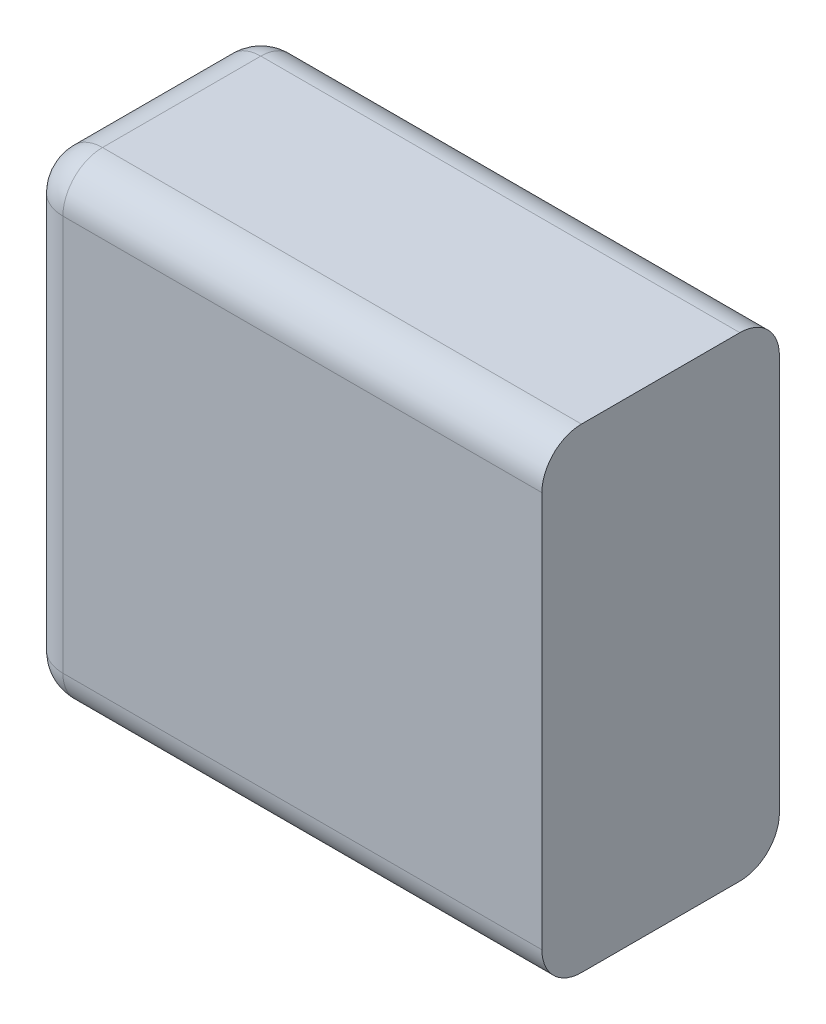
ISO-10303-21;
HEADER;
FILE_DESCRIPTION(('STEP AP214'),'2;1');
FILE_NAME('part.step','',(''),(''),'','','');
FILE_SCHEMA(('AUTOMOTIVE_DESIGN { 1 0 10303 214 1 1 1 1 }'));
ENDSEC;
DATA;
#1=APPLICATION_CONTEXT('core data for automotive mechanical design processes');
#2=APPLICATION_PROTOCOL_DEFINITION('international standard','automotive_design',2000,#1);
#3=PRODUCT_CONTEXT('',#1,'mechanical');
#4=PRODUCT('Part','Part','',(#3));
#5=PRODUCT_RELATED_PRODUCT_CATEGORY('part','',(#4));
#6=PRODUCT_DEFINITION_FORMATION('','',#4);
#7=PRODUCT_DEFINITION_CONTEXT('part definition',#1,'design');
#8=PRODUCT_DEFINITION('design','',#6,#7);
#9=PRODUCT_DEFINITION_SHAPE('','',#8);
#10=(LENGTH_UNIT() NAMED_UNIT(*) SI_UNIT(.MILLI.,.METRE.));
#11=(NAMED_UNIT(*) PLANE_ANGLE_UNIT() SI_UNIT($,.RADIAN.));
#12=(NAMED_UNIT(*) SI_UNIT($,.STERADIAN.) SOLID_ANGLE_UNIT());
#13=UNCERTAINTY_MEASURE_WITH_UNIT(LENGTH_MEASURE(1.E-05),#10,'distance_accuracy_value','');
#14=(GEOMETRIC_REPRESENTATION_CONTEXT(3) GLOBAL_UNCERTAINTY_ASSIGNED_CONTEXT((#13)) GLOBAL_UNIT_ASSIGNED_CONTEXT((#10,
#11,#12)) REPRESENTATION_CONTEXT('',''));
#15=CARTESIAN_POINT('',(0.,0.,0.));
#16=DIRECTION('',(0.,0.,1.));
#17=DIRECTION('',(1.,0.,0.));
#18=AXIS2_PLACEMENT_3D('',#15,#16,#17);
#19=CARTESIAN_POINT('',(680.,330.,400.));
#20=DIRECTION('',(0.,0.,1.));
#21=DIRECTION('',(1.,0.,0.));
#22=AXIS2_PLACEMENT_3D('',#19,#20,#21);
#23=PLANE('',#22);
#24=DIRECTION('',(0.,-1.,0.));
#25=VECTOR('',#24,1.);
#26=CARTESIAN_POINT('',(75.,330.,400.));
#27=LINE('',#26,#25);
#28=CARTESIAN_POINT('',(75.,250.,400.));
#29=VERTEX_POINT('',#28);
#30=CARTESIAN_POINT('',(75.,-250.,400.));
#31=VERTEX_POINT('',#30);
#32=EDGE_CURVE('E144',#29,#31,#27,.T.);
#33=ORIENTED_EDGE('',*,*,#32,.T.);
#34=DIRECTION('',(-1.,0.,0.));
#35=VECTOR('',#34,1.);
#36=CARTESIAN_POINT('',(680.,-250.,400.));
#37=LINE('',#36,#35);
#38=CARTESIAN_POINT('',(680.,-250.,400.));
#39=VERTEX_POINT('',#38);
#40=EDGE_CURVE('E143',#39,#31,#37,.T.);
#41=ORIENTED_EDGE('',*,*,#40,.F.);
#42=DIRECTION('',(0.,1.,0.));
#43=VECTOR('',#42,1.);
#44=CARTESIAN_POINT('',(680.,330.,400.));
#45=LINE('',#44,#43);
#46=CARTESIAN_POINT('',(680.,250.,400.));
#47=VERTEX_POINT('',#46);
#48=EDGE_CURVE('E11',#39,#47,#45,.T.);
#49=ORIENTED_EDGE('',*,*,#48,.T.);
#50=DIRECTION('',(-1.,0.,0.));
#51=VECTOR('',#50,1.);
#52=CARTESIAN_POINT('',(680.,250.,400.));
#53=LINE('',#52,#51);
#54=EDGE_CURVE('E57',#47,#29,#53,.T.);
#55=ORIENTED_EDGE('',*,*,#54,.T.);
#56=EDGE_LOOP('',(#33,#41,#49,#55));
#57=FACE_BOUND('',#56,.T.);
#58=ADVANCED_FACE('F46',(#57),#23,.T.);
#59=CARTESIAN_POINT('',(680.,-330.,100.));
#60=DIRECTION('',(0.,0.,-1.));
#61=DIRECTION('',(0.,-1.,0.));
#62=AXIS2_PLACEMENT_3D('',#59,#60,#61);
#63=PLANE('',#62);
#64=DIRECTION('',(0.,-1.,0.));
#65=VECTOR('',#64,1.);
#66=CARTESIAN_POINT('',(680.,-330.,100.));
#67=LINE('',#66,#65);
#68=CARTESIAN_POINT('',(680.,250.,100.));
#69=VERTEX_POINT('',#68);
#70=CARTESIAN_POINT('',(680.,-250.,100.));
#71=VERTEX_POINT('',#70);
#72=EDGE_CURVE('E123',#69,#71,#67,.T.);
#73=ORIENTED_EDGE('',*,*,#72,.T.);
#74=DIRECTION('',(1.,0.,0.));
#75=VECTOR('',#74,1.);
#76=CARTESIAN_POINT('',(680.,-250.,100.));
#77=LINE('',#76,#75);
#78=CARTESIAN_POINT('',(75.,-250.,100.));
#79=VERTEX_POINT('',#78);
#80=EDGE_CURVE('E196',#79,#71,#77,.T.);
#81=ORIENTED_EDGE('',*,*,#80,.F.);
#82=DIRECTION('',(0.,1.,0.));
#83=VECTOR('',#82,1.);
#84=CARTESIAN_POINT('',(75.,-330.,100.));
#85=LINE('',#84,#83);
#86=CARTESIAN_POINT('',(75.,250.,100.));
#87=VERTEX_POINT('',#86);
#88=EDGE_CURVE('E148',#79,#87,#85,.T.);
#89=ORIENTED_EDGE('',*,*,#88,.T.);
#90=DIRECTION('',(1.,0.,0.));
#91=VECTOR('',#90,1.);
#92=CARTESIAN_POINT('',(680.,250.,100.));
#93=LINE('',#92,#91);
#94=EDGE_CURVE('E149',#87,#69,#93,.T.);
#95=ORIENTED_EDGE('',*,*,#94,.T.);
#96=EDGE_LOOP('',(#73,#81,#89,#95));
#97=FACE_BOUND('',#96,.T.);
#98=ADVANCED_FACE('F311',(#97),#63,.T.);
#99=CARTESIAN_POINT('',(680.,300.,100.));
#100=DIRECTION('',(0.,1.,0.));
#101=DIRECTION('',(1.,0.,0.));
#102=AXIS2_PLACEMENT_3D('',#99,#100,#101);
#103=PLANE('',#102);
#104=DIRECTION('',(1.,0.,0.));
#105=VECTOR('',#104,1.);
#106=CARTESIAN_POINT('',(680.,300.,350.));
#107=LINE('',#106,#105);
#108=CARTESIAN_POINT('',(75.,300.,350.));
#109=VERTEX_POINT('',#108);
#110=CARTESIAN_POINT('',(680.,300.,350.));
#111=VERTEX_POINT('',#110);
#112=EDGE_CURVE('E114',#109,#111,#107,.T.);
#113=ORIENTED_EDGE('',*,*,#112,.T.);
#114=DIRECTION('',(0.,0.,-1.));
#115=VECTOR('',#114,1.);
#116=CARTESIAN_POINT('',(680.,300.,100.));
#117=LINE('',#116,#115);
#118=CARTESIAN_POINT('',(680.,300.,150.));
#119=VERTEX_POINT('',#118);
#120=EDGE_CURVE('E108',#111,#119,#117,.T.);
#121=ORIENTED_EDGE('',*,*,#120,.T.);
#122=DIRECTION('',(-1.,0.,0.));
#123=VECTOR('',#122,1.);
#124=CARTESIAN_POINT('',(680.,300.,150.));
#125=LINE('',#124,#123);
#126=CARTESIAN_POINT('',(75.,300.,150.));
#127=VERTEX_POINT('',#126);
#128=EDGE_CURVE('E101',#119,#127,#125,.T.);
#129=ORIENTED_EDGE('',*,*,#128,.T.);
#130=DIRECTION('',(0.,0.,1.));
#131=VECTOR('',#130,1.);
#132=CARTESIAN_POINT('',(75.,300.,100.));
#133=LINE('',#132,#131);
#134=EDGE_CURVE('E109',#127,#109,#133,.T.);
#135=ORIENTED_EDGE('',*,*,#134,.T.);
#136=EDGE_LOOP('',(#113,#121,#129,#135));
#137=FACE_BOUND('',#136,.T.);
#138=ADVANCED_FACE('F112',(#137),#103,.T.);
#139=CARTESIAN_POINT('',(680.,0.,100.));
#140=DIRECTION('',(-1.,0.,0.));
#141=DIRECTION('',(0.,0.,1.));
#142=AXIS2_PLACEMENT_3D('',#139,#140,#141);
#143=PLANE('',#142);
#144=ORIENTED_EDGE('',*,*,#48,.F.);
#145=CARTESIAN_POINT('',(680.,-250.,350.));
#146=DIRECTION('',(-1.,0.,0.));
#147=DIRECTION('',(0.,0.,-1.));
#148=AXIS2_PLACEMENT_3D('',#145,#146,#147);
#149=CIRCLE('',#148,50.);
#150=CARTESIAN_POINT('',(680.,-300.,350.));
#151=VERTEX_POINT('',#150);
#152=EDGE_CURVE('E224',#151,#39,#149,.T.);
#153=ORIENTED_EDGE('',*,*,#152,.F.);
#154=DIRECTION('',(0.,0.,-1.));
#155=VECTOR('',#154,1.);
#156=CARTESIAN_POINT('',(680.,-300.,100.));
#157=LINE('',#156,#155);
#158=CARTESIAN_POINT('',(680.,-300.,150.));
#159=VERTEX_POINT('',#158);
#160=EDGE_CURVE('E197',#151,#159,#157,.T.);
#161=ORIENTED_EDGE('',*,*,#160,.T.);
#162=CARTESIAN_POINT('',(680.,-250.,150.));
#163=DIRECTION('',(-1.,0.,0.));
#164=DIRECTION('',(0.,0.,-1.));
#165=AXIS2_PLACEMENT_3D('',#162,#163,#164);
#166=CIRCLE('',#165,50.);
#167=EDGE_CURVE('E213',#71,#159,#166,.T.);
#168=ORIENTED_EDGE('',*,*,#167,.F.);
#169=ORIENTED_EDGE('',*,*,#72,.F.);
#170=CARTESIAN_POINT('',(680.,250.,150.));
#171=DIRECTION('',(1.,0.,0.));
#172=DIRECTION('',(0.,0.,-1.));
#173=AXIS2_PLACEMENT_3D('',#170,#171,#172);
#174=CIRCLE('',#173,50.);
#175=EDGE_CURVE('E104',#69,#119,#174,.T.);
#176=ORIENTED_EDGE('',*,*,#175,.T.);
#177=ORIENTED_EDGE('',*,*,#120,.F.);
#178=CARTESIAN_POINT('',(680.,250.,350.));
#179=DIRECTION('',(1.,0.,0.));
#180=DIRECTION('',(0.,0.,-1.));
#181=AXIS2_PLACEMENT_3D('',#178,#179,#180);
#182=CIRCLE('',#181,50.);
#183=EDGE_CURVE('E126',#111,#47,#182,.T.);
#184=ORIENTED_EDGE('',*,*,#183,.T.);
#185=EDGE_LOOP('',(#144,#153,#161,#168,#169,#176,#177,#184));
#186=FACE_BOUND('',#185,.T.);
#187=ADVANCED_FACE('F120',(#186),#143,.F.);
#188=CARTESIAN_POINT('',(25.,0.,100.));
#189=DIRECTION('',(-1.,0.,0.));
#190=DIRECTION('',(0.,0.,1.));
#191=AXIS2_PLACEMENT_3D('',#188,#189,#190);
#192=PLANE('',#191);
#193=DIRECTION('',(0.,-1.,0.));
#194=VECTOR('',#193,1.);
#195=CARTESIAN_POINT('',(25.,0.,150.));
#196=LINE('',#195,#194);
#197=CARTESIAN_POINT('',(25.,250.,150.));
#198=VERTEX_POINT('',#197);
#199=CARTESIAN_POINT('',(25.,-250.,150.));
#200=VERTEX_POINT('',#199);
#201=EDGE_CURVE('E160',#198,#200,#196,.T.);
#202=ORIENTED_EDGE('',*,*,#201,.T.);
#203=DIRECTION('',(0.,0.,-1.));
#204=VECTOR('',#203,1.);
#205=CARTESIAN_POINT('',(25.,-250.,100.));
#206=LINE('',#205,#204);
#207=CARTESIAN_POINT('',(25.,-250.,350.));
#208=VERTEX_POINT('',#207);
#209=EDGE_CURVE('E191',#208,#200,#206,.T.);
#210=ORIENTED_EDGE('',*,*,#209,.F.);
#211=DIRECTION('',(0.,1.,0.));
#212=VECTOR('',#211,1.);
#213=CARTESIAN_POINT('',(25.,0.,350.));
#214=LINE('',#213,#212);
#215=CARTESIAN_POINT('',(25.,250.,350.));
#216=VERTEX_POINT('',#215);
#217=EDGE_CURVE('E133',#208,#216,#214,.T.);
#218=ORIENTED_EDGE('',*,*,#217,.T.);
#219=DIRECTION('',(0.,0.,-1.));
#220=VECTOR('',#219,1.);
#221=CARTESIAN_POINT('',(25.,250.,100.));
#222=LINE('',#221,#220);
#223=EDGE_CURVE('E164',#216,#198,#222,.T.);
#224=ORIENTED_EDGE('',*,*,#223,.T.);
#225=EDGE_LOOP('',(#202,#210,#218,#224));
#226=FACE_BOUND('',#225,.T.);
#227=ADVANCED_FACE('F295',(#226),#192,.T.);
#228=CARTESIAN_POINT('',(680.,250.,150.));
#229=DIRECTION('',(1.,0.,0.));
#230=DIRECTION('',(0.,0.,-1.));
#231=AXIS2_PLACEMENT_3D('',#228,#229,#230);
#232=CYLINDRICAL_SURFACE('',#231,50.);
#233=ORIENTED_EDGE('',*,*,#128,.F.);
#234=ORIENTED_EDGE('',*,*,#175,.F.);
#235=ORIENTED_EDGE('',*,*,#94,.F.);
#236=CARTESIAN_POINT('',(75.,250.,150.));
#237=DIRECTION('',(1.,0.,0.));
#238=DIRECTION('',(0.,0.,-1.));
#239=AXIS2_PLACEMENT_3D('',#236,#237,#238);
#240=CIRCLE('',#239,50.);
#241=EDGE_CURVE('E97',#87,#127,#240,.T.);
#242=ORIENTED_EDGE('',*,*,#241,.T.);
#243=EDGE_LOOP('',(#233,#234,#235,#242));
#244=FACE_BOUND('',#243,.T.);
#245=ADVANCED_FACE('F48',(#244),#232,.T.);
#246=CARTESIAN_POINT('',(680.,250.,350.));
#247=DIRECTION('',(1.,0.,0.));
#248=DIRECTION('',(0.,0.,-1.));
#249=AXIS2_PLACEMENT_3D('',#246,#247,#248);
#250=CYLINDRICAL_SURFACE('',#249,50.);
#251=ORIENTED_EDGE('',*,*,#54,.F.);
#252=ORIENTED_EDGE('',*,*,#183,.F.);
#253=ORIENTED_EDGE('',*,*,#112,.F.);
#254=CARTESIAN_POINT('',(75.,250.,350.));
#255=DIRECTION('',(1.,0.,0.));
#256=DIRECTION('',(0.,0.,-1.));
#257=AXIS2_PLACEMENT_3D('',#254,#255,#256);
#258=CIRCLE('',#257,50.);
#259=EDGE_CURVE('E91',#109,#29,#258,.T.);
#260=ORIENTED_EDGE('',*,*,#259,.T.);
#261=EDGE_LOOP('',(#251,#252,#253,#260));
#262=FACE_BOUND('',#261,.T.);
#263=ADVANCED_FACE('F330',(#262),#250,.T.);
#264=CARTESIAN_POINT('',(75.,0.,350.));
#265=DIRECTION('',(0.,1.,0.));
#266=DIRECTION('',(0.,0.,1.));
#267=AXIS2_PLACEMENT_3D('',#264,#265,#266);
#268=CYLINDRICAL_SURFACE('',#267,50.);
#269=ORIENTED_EDGE('',*,*,#217,.F.);
#270=CARTESIAN_POINT('',(75.,-250.,350.));
#271=DIRECTION('',(0.,1.,0.));
#272=DIRECTION('',(0.,0.,1.));
#273=AXIS2_PLACEMENT_3D('',#270,#271,#272);
#274=CIRCLE('',#273,50.);
#275=EDGE_CURVE('E181',#208,#31,#274,.T.);
#276=ORIENTED_EDGE('',*,*,#275,.T.);
#277=ORIENTED_EDGE('',*,*,#32,.F.);
#278=CARTESIAN_POINT('',(75.,250.,350.));
#279=DIRECTION('',(0.,1.,0.));
#280=DIRECTION('',(0.,0.,1.));
#281=AXIS2_PLACEMENT_3D('',#278,#279,#280);
#282=CIRCLE('',#281,50.);
#283=EDGE_CURVE('E50',#216,#29,#282,.T.);
#284=ORIENTED_EDGE('',*,*,#283,.F.);
#285=EDGE_LOOP('',(#269,#276,#277,#284));
#286=FACE_BOUND('',#285,.T.);
#287=ADVANCED_FACE('F288',(#286),#268,.T.);
#288=CARTESIAN_POINT('',(75.,250.,350.));
#289=DIRECTION('',(0.,0.,1.));
#290=DIRECTION('',(0.,1.,0.));
#291=AXIS2_PLACEMENT_3D('',#288,#289,#290);
#292=SPHERICAL_SURFACE('',#291,50.);
#293=ORIENTED_EDGE('',*,*,#259,.F.);
#294=CARTESIAN_POINT('',(75.,250.,350.));
#295=DIRECTION('',(0.,0.,-1.));
#296=DIRECTION('',(0.,1.,0.));
#297=AXIS2_PLACEMENT_3D('',#294,#295,#296);
#298=CIRCLE('',#297,50.);
#299=EDGE_CURVE('E156',#216,#109,#298,.T.);
#300=ORIENTED_EDGE('',*,*,#299,.F.);
#301=ORIENTED_EDGE('',*,*,#283,.T.);
#302=EDGE_LOOP('',(#293,#300,#301));
#303=FACE_BOUND('',#302,.T.);
#304=ADVANCED_FACE('F285',(#303),#292,.T.);
#305=CARTESIAN_POINT('',(75.,250.,100.));
#306=DIRECTION('',(0.,0.,-1.));
#307=DIRECTION('',(0.,1.,0.));
#308=AXIS2_PLACEMENT_3D('',#305,#306,#307);
#309=CYLINDRICAL_SURFACE('',#308,50.);
#310=CARTESIAN_POINT('',(75.,250.,150.));
#311=DIRECTION('',(0.,0.,-1.));
#312=DIRECTION('',(0.,1.,0.));
#313=AXIS2_PLACEMENT_3D('',#310,#311,#312);
#314=CIRCLE('',#313,50.);
#315=EDGE_CURVE('E142',#198,#127,#314,.T.);
#316=ORIENTED_EDGE('',*,*,#315,.F.);
#317=ORIENTED_EDGE('',*,*,#223,.F.);
#318=ORIENTED_EDGE('',*,*,#299,.T.);
#319=ORIENTED_EDGE('',*,*,#134,.F.);
#320=EDGE_LOOP('',(#316,#317,#318,#319));
#321=FACE_BOUND('',#320,.T.);
#322=ADVANCED_FACE('F291',(#321),#309,.T.);
#323=CARTESIAN_POINT('',(75.,250.,150.));
#324=DIRECTION('',(0.,0.,1.));
#325=DIRECTION('',(0.,1.,0.));
#326=AXIS2_PLACEMENT_3D('',#323,#324,#325);
#327=SPHERICAL_SURFACE('',#326,50.);
#328=ORIENTED_EDGE('',*,*,#241,.F.);
#329=CARTESIAN_POINT('',(75.,250.,150.));
#330=DIRECTION('',(0.,-1.,0.));
#331=DIRECTION('',(0.,0.,-1.));
#332=AXIS2_PLACEMENT_3D('',#329,#330,#331);
#333=CIRCLE('',#332,50.);
#334=EDGE_CURVE('E138',#198,#87,#333,.T.);
#335=ORIENTED_EDGE('',*,*,#334,.F.);
#336=ORIENTED_EDGE('',*,*,#315,.T.);
#337=EDGE_LOOP('',(#328,#335,#336));
#338=FACE_BOUND('',#337,.T.);
#339=ADVANCED_FACE('F299',(#338),#327,.T.);
#340=CARTESIAN_POINT('',(75.,0.,150.));
#341=DIRECTION('',(0.,-1.,0.));
#342=DIRECTION('',(0.,0.,-1.));
#343=AXIS2_PLACEMENT_3D('',#340,#341,#342);
#344=CYLINDRICAL_SURFACE('',#343,50.);
#345=ORIENTED_EDGE('',*,*,#88,.F.);
#346=CARTESIAN_POINT('',(75.,-250.,150.));
#347=DIRECTION('',(0.,-1.,0.));
#348=DIRECTION('',(0.,0.,-1.));
#349=AXIS2_PLACEMENT_3D('',#346,#347,#348);
#350=CIRCLE('',#349,50.);
#351=EDGE_CURVE('E220',#200,#79,#350,.T.);
#352=ORIENTED_EDGE('',*,*,#351,.F.);
#353=ORIENTED_EDGE('',*,*,#201,.F.);
#354=ORIENTED_EDGE('',*,*,#334,.T.);
#355=EDGE_LOOP('',(#345,#352,#353,#354));
#356=FACE_BOUND('',#355,.T.);
#357=ADVANCED_FACE('F297',(#356),#344,.T.);
#358=CARTESIAN_POINT('',(680.,-300.,100.));
#359=DIRECTION('',(0.,-1.,0.));
#360=DIRECTION('',(1.,0.,0.));
#361=AXIS2_PLACEMENT_3D('',#358,#359,#360);
#362=PLANE('',#361);
#363=DIRECTION('',(1.,0.,0.));
#364=VECTOR('',#363,1.);
#365=CARTESIAN_POINT('',(680.,-300.,350.));
#366=LINE('',#365,#364);
#367=CARTESIAN_POINT('',(75.,-300.,350.));
#368=VERTEX_POINT('',#367);
#369=EDGE_CURVE('E192',#368,#151,#366,.T.);
#370=ORIENTED_EDGE('',*,*,#369,.F.);
#371=DIRECTION('',(0.,0.,1.));
#372=VECTOR('',#371,1.);
#373=CARTESIAN_POINT('',(75.,-300.,100.));
#374=LINE('',#373,#372);
#375=CARTESIAN_POINT('',(75.,-300.,150.));
#376=VERTEX_POINT('',#375);
#377=EDGE_CURVE('E206',#376,#368,#374,.T.);
#378=ORIENTED_EDGE('',*,*,#377,.F.);
#379=DIRECTION('',(-1.,0.,0.));
#380=VECTOR('',#379,1.);
#381=CARTESIAN_POINT('',(680.,-300.,150.));
#382=LINE('',#381,#380);
#383=EDGE_CURVE('E202',#159,#376,#382,.T.);
#384=ORIENTED_EDGE('',*,*,#383,.F.);
#385=ORIENTED_EDGE('',*,*,#160,.F.);
#386=EDGE_LOOP('',(#370,#378,#384,#385));
#387=FACE_BOUND('',#386,.T.);
#388=ADVANCED_FACE('F262',(#387),#362,.T.);
#389=CARTESIAN_POINT('',(680.,-250.,150.));
#390=DIRECTION('',(1.,0.,0.));
#391=DIRECTION('',(0.,0.,-1.));
#392=AXIS2_PLACEMENT_3D('',#389,#390,#391);
#393=CYLINDRICAL_SURFACE('',#392,50.);
#394=ORIENTED_EDGE('',*,*,#383,.T.);
#395=CARTESIAN_POINT('',(75.,-250.,150.));
#396=DIRECTION('',(-1.,0.,0.));
#397=DIRECTION('',(0.,0.,-1.));
#398=AXIS2_PLACEMENT_3D('',#395,#396,#397);
#399=CIRCLE('',#398,50.);
#400=EDGE_CURVE('E187',#79,#376,#399,.T.);
#401=ORIENTED_EDGE('',*,*,#400,.F.);
#402=ORIENTED_EDGE('',*,*,#80,.T.);
#403=ORIENTED_EDGE('',*,*,#167,.T.);
#404=EDGE_LOOP('',(#394,#401,#402,#403));
#405=FACE_BOUND('',#404,.T.);
#406=ADVANCED_FACE('F259',(#405),#393,.T.);
#407=CARTESIAN_POINT('',(680.,-250.,350.));
#408=DIRECTION('',(1.,0.,0.));
#409=DIRECTION('',(0.,0.,-1.));
#410=AXIS2_PLACEMENT_3D('',#407,#408,#409);
#411=CYLINDRICAL_SURFACE('',#410,50.);
#412=ORIENTED_EDGE('',*,*,#40,.T.);
#413=CARTESIAN_POINT('',(75.,-250.,350.));
#414=DIRECTION('',(-1.,0.,0.));
#415=DIRECTION('',(0.,0.,-1.));
#416=AXIS2_PLACEMENT_3D('',#413,#414,#415);
#417=CIRCLE('',#416,50.);
#418=EDGE_CURVE('E185',#368,#31,#417,.T.);
#419=ORIENTED_EDGE('',*,*,#418,.F.);
#420=ORIENTED_EDGE('',*,*,#369,.T.);
#421=ORIENTED_EDGE('',*,*,#152,.T.);
#422=EDGE_LOOP('',(#412,#419,#420,#421));
#423=FACE_BOUND('',#422,.T.);
#424=ADVANCED_FACE('F268',(#423),#411,.T.);
#425=CARTESIAN_POINT('',(75.,-250.,350.));
#426=DIRECTION('',(0.,0.,1.));
#427=DIRECTION('',(0.,-1.,0.));
#428=AXIS2_PLACEMENT_3D('',#425,#426,#427);
#429=SPHERICAL_SURFACE('',#428,50.);
#430=ORIENTED_EDGE('',*,*,#418,.T.);
#431=ORIENTED_EDGE('',*,*,#275,.F.);
#432=CARTESIAN_POINT('',(75.,-250.,350.));
#433=DIRECTION('',(0.,0.,1.));
#434=DIRECTION('',(0.,-1.,0.));
#435=AXIS2_PLACEMENT_3D('',#432,#433,#434);
#436=CIRCLE('',#435,50.);
#437=EDGE_CURVE('E186',#208,#368,#436,.T.);
#438=ORIENTED_EDGE('',*,*,#437,.T.);
#439=EDGE_LOOP('',(#430,#431,#438));
#440=FACE_BOUND('',#439,.T.);
#441=ADVANCED_FACE('F443',(#440),#429,.T.);
#442=CARTESIAN_POINT('',(75.,-250.,100.));
#443=DIRECTION('',(0.,0.,-1.));
#444=DIRECTION('',(0.,-1.,0.));
#445=AXIS2_PLACEMENT_3D('',#442,#443,#444);
#446=CYLINDRICAL_SURFACE('',#445,50.);
#447=CARTESIAN_POINT('',(75.,-250.,150.));
#448=DIRECTION('',(0.,0.,1.));
#449=DIRECTION('',(0.,-1.,0.));
#450=AXIS2_PLACEMENT_3D('',#447,#448,#449);
#451=CIRCLE('',#450,50.);
#452=EDGE_CURVE('E201',#200,#376,#451,.T.);
#453=ORIENTED_EDGE('',*,*,#452,.T.);
#454=ORIENTED_EDGE('',*,*,#377,.T.);
#455=ORIENTED_EDGE('',*,*,#437,.F.);
#456=ORIENTED_EDGE('',*,*,#209,.T.);
#457=EDGE_LOOP('',(#453,#454,#455,#456));
#458=FACE_BOUND('',#457,.T.);
#459=ADVANCED_FACE('F243',(#458),#446,.T.);
#460=CARTESIAN_POINT('',(75.,-250.,150.));
#461=DIRECTION('',(0.,0.,1.));
#462=DIRECTION('',(0.,-1.,0.));
#463=AXIS2_PLACEMENT_3D('',#460,#461,#462);
#464=SPHERICAL_SURFACE('',#463,50.);
#465=ORIENTED_EDGE('',*,*,#400,.T.);
#466=ORIENTED_EDGE('',*,*,#452,.F.);
#467=ORIENTED_EDGE('',*,*,#351,.T.);
#468=EDGE_LOOP('',(#465,#466,#467));
#469=FACE_BOUND('',#468,.T.);
#470=ADVANCED_FACE('F253',(#469),#464,.T.);
#471=CLOSED_SHELL('',(#58,#98,#138,#187,#227,#245,#263,#287,#304,#322,#339,#357,#388,#406,#424,
#441,#459,#470));
#472=MANIFOLD_SOLID_BREP('B2',#471);
#473=ADVANCED_BREP_SHAPE_REPRESENTATION('',(#18,#472),#14);
#474=SHAPE_DEFINITION_REPRESENTATION(#9,#473);
ENDSEC;
END-ISO-10303-21;
